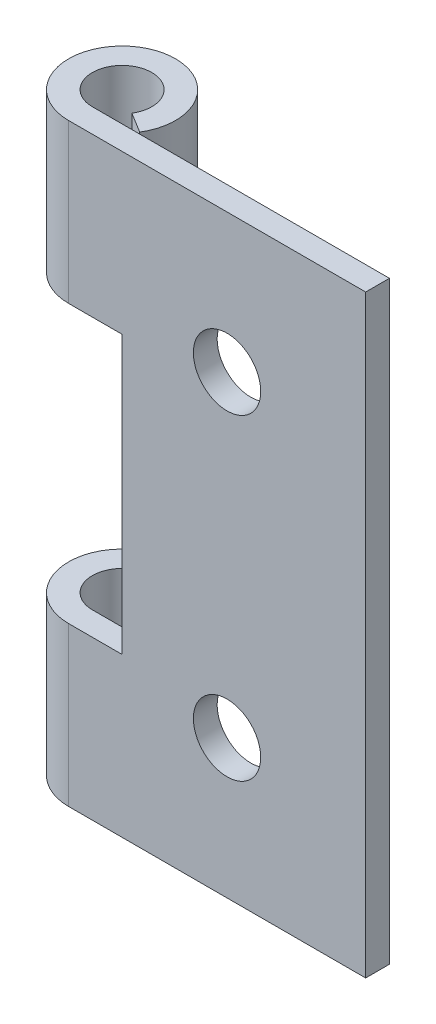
from build123d import *

# Parameters (mm, degrees)
Y_KSEKLIK_EKSTR_ZYON1_DEPTH = 30
KES_EKSTR_ZYON2_START       = -22
KES_EKSTR_ZYON2_DEPTH       = 14
IZIM4_R                     = 1.7
KES_EKSTR_ZYON3_DEPTH       = 1.2


with BuildPart() as part:
    # izim1 → Y_kseklik-Ekstr_zyon1 (new body)
    with BuildSketch(Plane(origin=(0, 0, 0), x_dir=(1, 0, 0), z_dir=(0, 1, 0))):
        with BuildLine():
            Line((0, 0.6), (15, 0.6))
            Line((15, 0.6), (15, -0.6))
            Line((15, -0.6), (0, -0.6))
            ThreePointArc((0, -0.6), (-1.319038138, 4.455873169), (2.301841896, 0.688786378))
            Line((2.301841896, 0.688786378), (1.278801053, 1.315992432))
            ThreePointArc((1.278801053, 1.315992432), (-0.732798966, 3.408818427), (0, 0.6))
        make_face()
    extrude(amount=-Y_KSEKLIK_EKSTR_ZYON1_DEPTH)

    # izim3 → Kes-Ekstr_zyon2 (cut)
    with BuildSketch(Plane.XZ.offset(30).offset(KES_EKSTR_ZYON2_START)):
        with BuildLine():
            Line((1.278801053, -1.315992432), (2.301841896, -0.688786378))
            ThreePointArc((2.301841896, -0.688786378), (-1.319038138, -4.455873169), (0, 0.6))
            Line((0, 0.6), (2.7, 0.6))
            Line((2.7, 0.6), (2.7, -0.6))
            Line((2.7, -0.6), (0, -0.6))
            ThreePointArc((0, -0.6), (-0.732798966, -3.408818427), (1.278801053, -1.315992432))
        make_face()
    extrude(amount=KES_EKSTR_ZYON2_DEPTH, mode=Mode.SUBTRACT)

    # izim4 → Kes-Ekstr_zyon3 (cut)
    with BuildSketch(Plane(origin=(0, 0, -0.6), x_dir=(-1, 0, 0), z_dir=(0, 0, -1))):
        with Locations((-8, -23)):
            Circle(IZIM4_R)
        with Locations((-8, -7)):
            Circle(IZIM4_R)
    extrude(amount=-KES_EKSTR_ZYON3_DEPTH, mode=Mode.SUBTRACT)


solid = part.part
